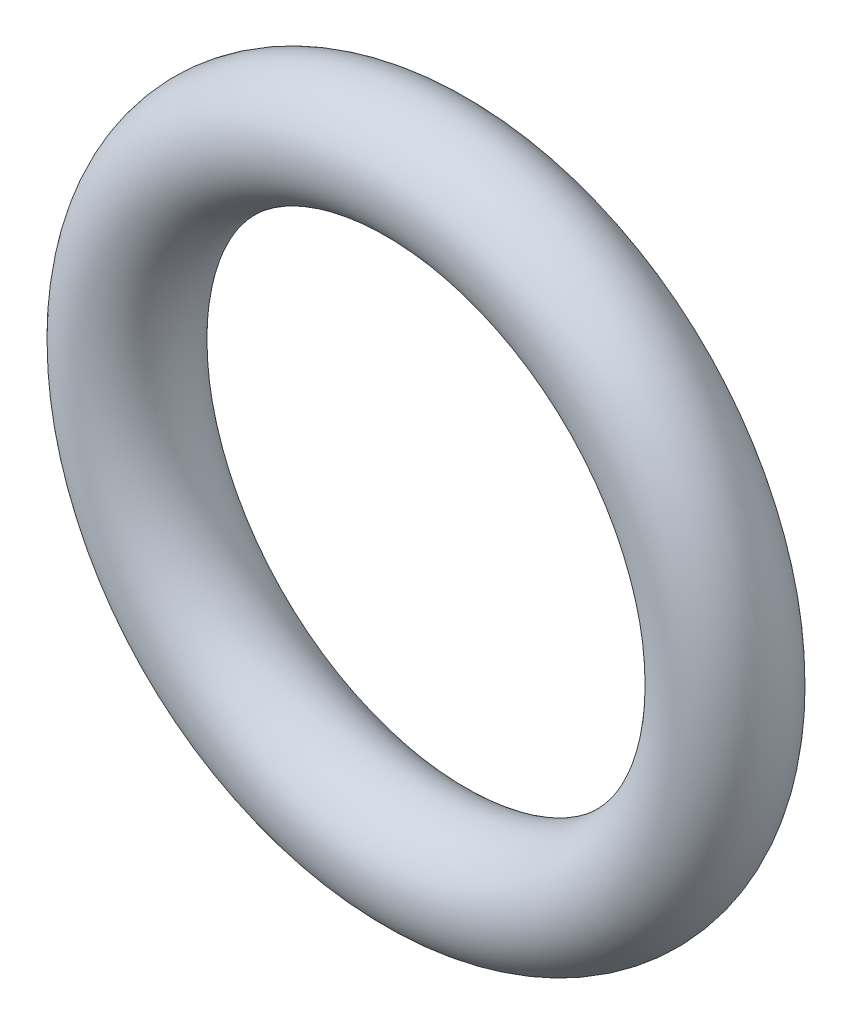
ISO-10303-21;
HEADER;
FILE_DESCRIPTION(('STEP AP214'),'2;1');
FILE_NAME('part.step','',(''),(''),'','','');
FILE_SCHEMA(('AUTOMOTIVE_DESIGN { 1 0 10303 214 1 1 1 1 }'));
ENDSEC;
DATA;
#1=APPLICATION_CONTEXT('core data for automotive mechanical design processes');
#2=APPLICATION_PROTOCOL_DEFINITION('international standard','automotive_design',2000,#1);
#3=PRODUCT_CONTEXT('',#1,'mechanical');
#4=PRODUCT('Part','Part','',(#3));
#5=PRODUCT_RELATED_PRODUCT_CATEGORY('part','',(#4));
#6=PRODUCT_DEFINITION_FORMATION('','',#4);
#7=PRODUCT_DEFINITION_CONTEXT('part definition',#1,'design');
#8=PRODUCT_DEFINITION('design','',#6,#7);
#9=PRODUCT_DEFINITION_SHAPE('','',#8);
#10=(LENGTH_UNIT() NAMED_UNIT(*) SI_UNIT(.MILLI.,.METRE.));
#11=(NAMED_UNIT(*) PLANE_ANGLE_UNIT() SI_UNIT($,.RADIAN.));
#12=(NAMED_UNIT(*) SI_UNIT($,.STERADIAN.) SOLID_ANGLE_UNIT());
#13=UNCERTAINTY_MEASURE_WITH_UNIT(LENGTH_MEASURE(1.E-05),#10,'distance_accuracy_value','');
#14=(GEOMETRIC_REPRESENTATION_CONTEXT(3) GLOBAL_UNCERTAINTY_ASSIGNED_CONTEXT((#13)) GLOBAL_UNIT_ASSIGNED_CONTEXT((#10,
#11,#12)) REPRESENTATION_CONTEXT('',''));
#15=CARTESIAN_POINT('',(0.,0.,0.));
#16=DIRECTION('',(0.,0.,1.));
#17=DIRECTION('',(1.,0.,0.));
#18=AXIS2_PLACEMENT_3D('',#15,#16,#17);
#19=CARTESIAN_POINT('',(0.,0.,1.75));
#20=DIRECTION('',(0.,0.,-1.));
#21=DIRECTION('',(-1.,0.,0.));
#22=AXIS2_PLACEMENT_3D('',#19,#20,#21);
#23=TOROIDAL_SURFACE('',#22,9.25,1.75);
#24=ADVANCED_FACE('F12',(),#23,.T.);
#25=CLOSED_SHELL('',(#24));
#26=MANIFOLD_SOLID_BREP('B1',#25);
#27=ADVANCED_BREP_SHAPE_REPRESENTATION('',(#18,#26),#14);
#28=SHAPE_DEFINITION_REPRESENTATION(#9,#27);
ENDSEC;
END-ISO-10303-21;
